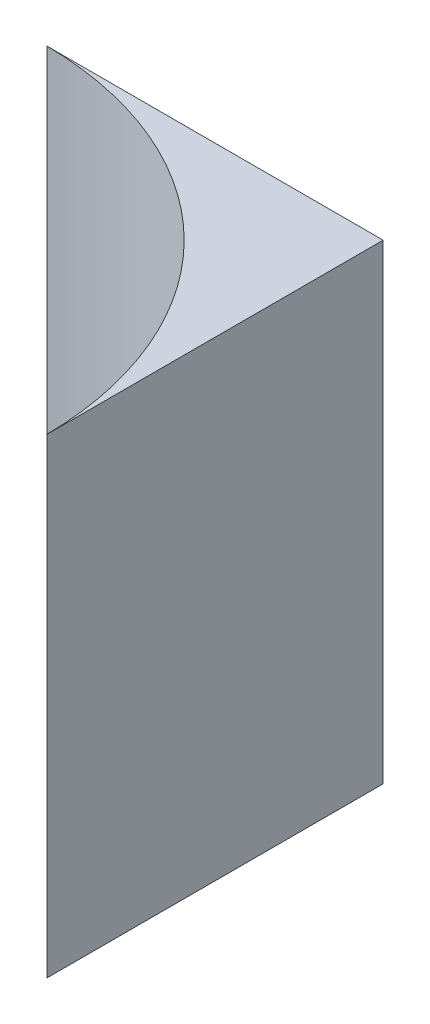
from build123d import *

# Parameters (mm, degrees)
BOSS_EXTRUDE1_DEPTH = 35
SKETCH2_W           = 33.9026737
SKETCH2_H           = 51.397979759
CUT_EXTRUDE1_DEPTH  = 50.749371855
SKETCH3_W           = 53.962654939
SKETCH3_H           = 25.951474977
CUT_EXTRUDE2_DEPTH  = 50.749371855
SCALE1_SCALE        = 0.9


with BuildPart() as part:
    # Sketch1 → Boss-Extrude1 (new body)
    with BuildSketch(Plane(origin=(0, 0, 0), x_dir=(1, 0, 0), z_dir=(0, 1, 0))):
        with BuildLine():
            ThreePointArc((-25, -0.001237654), (-7.395553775, -7.395553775), (-0.001237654, -25))
            Line((-0.001237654, -25), (0.001237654, -25))
            ThreePointArc((0.001237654, -25), (7.395553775, -7.395553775), (25, -0.001237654))
            Line((25, -0.001237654), (25, 0.001237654))
            ThreePointArc((25, 0.001237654), (7.395553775, 7.395553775), (0.001237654, 25))
            Line((0.001237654, 25), (-0.001237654, 25))
            ThreePointArc((-0.001237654, 25), (-7.395553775, 7.395553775), (-25, 0.001237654))
            Line((-25, 0.001237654), (-25, -0.001237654))
        make_face()
    extrude(amount=BOSS_EXTRUDE1_DEPTH)

    # Sketch2 → Cut-Extrude1 (cut, through all)
    with BuildSketch(Plane(origin=(0, 35, 0), x_dir=(1, 0, 0), z_dir=(0, 1, 0))):
        with Locations((16.952574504, -0.69898988)):
            Rectangle(SKETCH2_W, SKETCH2_H)
    extrude(amount=-CUT_EXTRUDE1_DEPTH, mode=Mode.SUBTRACT)

    # Sketch3 → Cut-Extrude2 (cut, through all)
    with BuildSketch(Plane(origin=(0, 35, 0), x_dir=(1, 0, 0), z_dir=(0, 1, 0))):
        with Locations((1.98132747, 12.976975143)):
            Rectangle(SKETCH3_W, SKETCH3_H)
    extrude(amount=-CUT_EXTRUDE2_DEPTH, mode=Mode.SUBTRACT)


with BuildPart() as part_1:
    # Scale1: scaled about (-5.640305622, 17.5, 5.640305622)
    add(part.part.scale(SCALE1_SCALE).moved(Location((-0.564030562, 1.75, 0.564030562))))


solid = part_1.part
